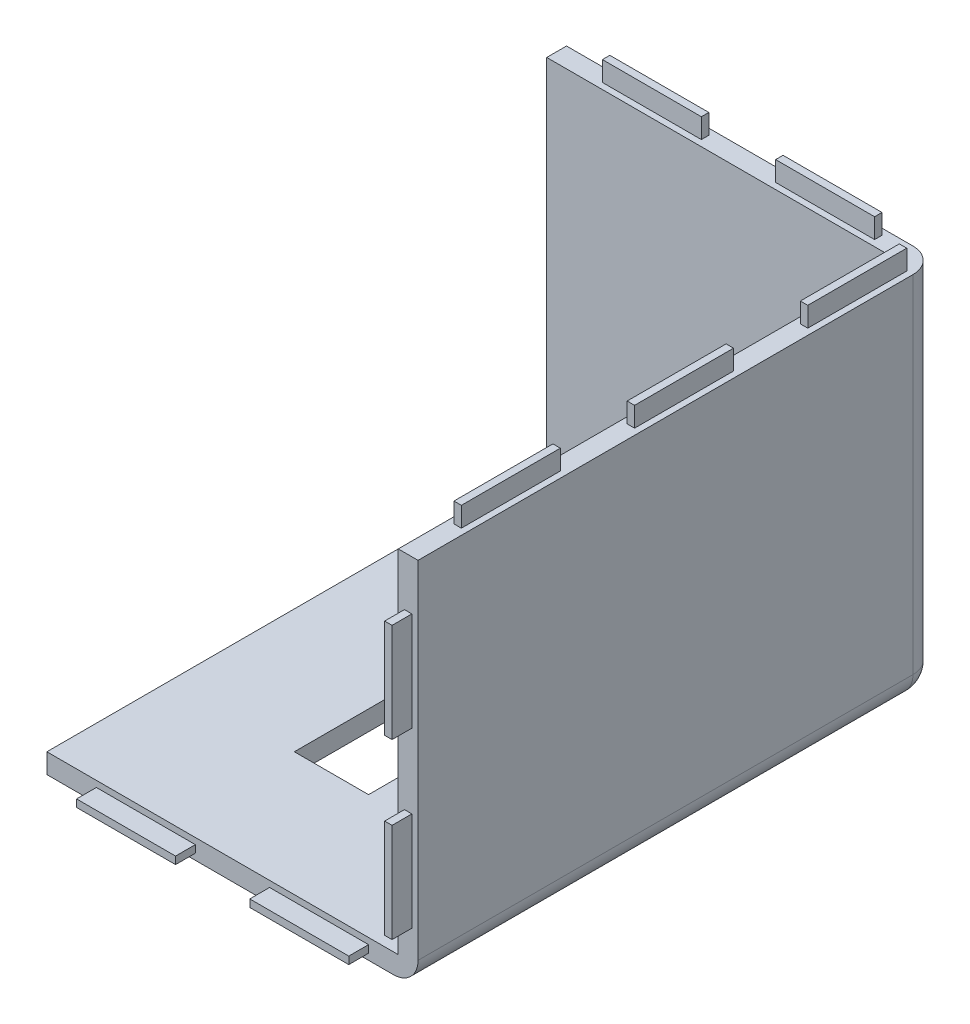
from build123d import *

# Parameters (mm, degrees)
CROQUIS1_W              = 150
CROQUIS1_H              = 210
SALIENTE_EXTRUIR1_DEPTH = 150
CROQUIS2_W              = 142
CROQUIS2_H              = 202
CORTAR_EXTRUIR1_DEPTH   = 142
CROQUIS8_W              = 40
CROQUIS8_H              = 3
CROQUIS8_W_2            = 3
CROQUIS8_H_2            = 40
SALIENTE_EXTRUIR5_DEPTH = 8
CROQUIS9_W              = 3
CROQUIS9_H              = 40
CROQUIS9_W_2            = 40
CROQUIS9_H_2            = 3
CORTAR_EXTRUIR5_DEPTH   = 8
CROQUIS10_W             = 3
CROQUIS10_H             = 40
CROQUIS10_W_2           = 40
CROQUIS10_H_2           = 3
SALIENTE_EXTRUIR6_DEPTH = 8
CROQUIS11_W             = 30
CROQUIS11_H             = 60
CORTAR_EXTRUIR6_DEPTH   = 8
REDONDEO2_R             = 10


with BuildPart() as part:
    # Croquis1 → Saliente-Extruir1 (new body)
    with BuildSketch(Plane(origin=(0, 0, 0), x_dir=(1, 0, 0), z_dir=(0, 1, 0))):
        with Locations((75, 105)):
            Rectangle(CROQUIS1_W, CROQUIS1_H)
    extrude(amount=SALIENTE_EXTRUIR1_DEPTH)

    # Croquis2 → Cortar-Extruir1 (cut)
    with BuildSketch(Plane(origin=(0, 150, 0), x_dir=(1, 0, 0), z_dir=(0, 1, 0))):
        with Locations((71, 101)):
            Rectangle(CROQUIS2_W, CROQUIS2_H)
    extrude(amount=-CORTAR_EXTRUIR1_DEPTH, mode=Mode.SUBTRACT)

    # Croquis8 → Saliente-Extruir5 (add)
    with BuildSketch(Plane(origin=(0, 150, 0), x_dir=(1, 0, 0), z_dir=(0, 1, 0))):
        with Locations((40, 206)):
            Rectangle(CROQUIS8_W, CROQUIS8_H)
        with Locations((110, 206)):
            Rectangle(CROQUIS8_W, CROQUIS8_H)
        with Locations((146, 40)):
            Rectangle(CROQUIS8_W_2, CROQUIS8_H_2)
        with Locations((146, 110)):
            Rectangle(CROQUIS8_W_2, CROQUIS8_H_2)
        with Locations((146, 180)):
            Rectangle(CROQUIS8_W_2, CROQUIS8_H_2)
    extrude(amount=SALIENTE_EXTRUIR5_DEPTH)

    # Croquis9 → Cortar-Extruir5 (cut)
    with BuildSketch(Plane.ZY):
        with Locations((-206, 110)):
            Rectangle(CROQUIS9_W, CROQUIS9_H)
        with Locations((-206, 40)):
            Rectangle(CROQUIS9_W, CROQUIS9_H)
        with Locations((-40, 4)):
            Rectangle(CROQUIS9_W_2, CROQUIS9_H_2)
        with Locations((-110, 4)):
            Rectangle(CROQUIS9_W_2, CROQUIS9_H_2)
        with Locations((-180, 4)):
            Rectangle(CROQUIS9_W_2, CROQUIS9_H_2)
    extrude(amount=-CORTAR_EXTRUIR5_DEPTH, mode=Mode.SUBTRACT)

    # Croquis10 → Saliente-Extruir6 (add)
    with BuildSketch(Plane.XY):
        with Locations((146, 110)):
            Rectangle(CROQUIS10_W, CROQUIS10_H)
        with Locations((146, 40)):
            Rectangle(CROQUIS10_W, CROQUIS10_H)
        with Locations((40, 4)):
            Rectangle(CROQUIS10_W_2, CROQUIS10_H_2)
        with Locations((110, 4)):
            Rectangle(CROQUIS10_W_2, CROQUIS10_H_2)
    extrude(amount=SALIENTE_EXTRUIR6_DEPTH)

    # Croquis11 → Cortar-Extruir6 (cut)
    with BuildSketch(Plane(origin=(0, 8, 0), x_dir=(1, 0, 0), z_dir=(0, 1, 0))):
        with Locations((65, 80)):
            Rectangle(CROQUIS11_W, CROQUIS11_H)
    extrude(amount=-CORTAR_EXTRUIR6_DEPTH, mode=Mode.SUBTRACT)

    # Redondeo2
    redondeo2_edges = [part.edges().sort_by_distance(p)[0] for p in [
        (75, 0, -210),
        (150, 0, -105),
        (150, 75, -210),
    ]]
    fillet(redondeo2_edges, radius=REDONDEO2_R)


solid = part.part
